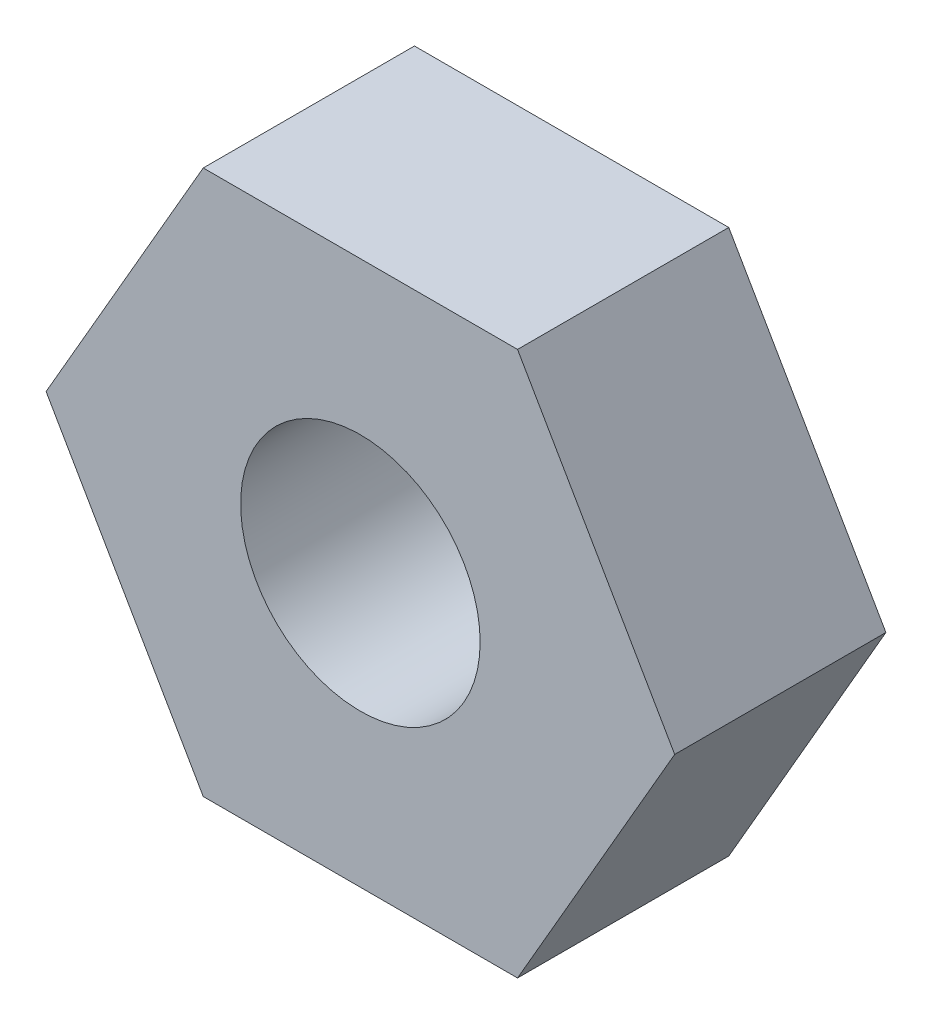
from build123d import *

# Parameters (mm, degrees)
BOSS_EXTRUDE1_DEPTH = 2.4638
SKETCH2_R           = 1.397
CUT_EXTRUDE1_DEPTH  = 6.439831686


with BuildPart() as part:
    # Sketch1 → Boss-Extrude1 (new body)
    with BuildSketch(Plane.XY):
        Polygon((3.666174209, 0), (1.833087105, 3.175), (-1.833087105, 3.175), (-3.666174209, 0), (-1.833087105, -3.175), (1.833087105, -3.175), align=None)
    extrude(amount=BOSS_EXTRUDE1_DEPTH)

    # Sketch2 → Cut-Extrude1 (cut, through all)
    with BuildSketch(Plane.XY.offset(2.4638)):
        Circle(SKETCH2_R)
    extrude(amount=-CUT_EXTRUDE1_DEPTH, mode=Mode.SUBTRACT)


solid = part.part
